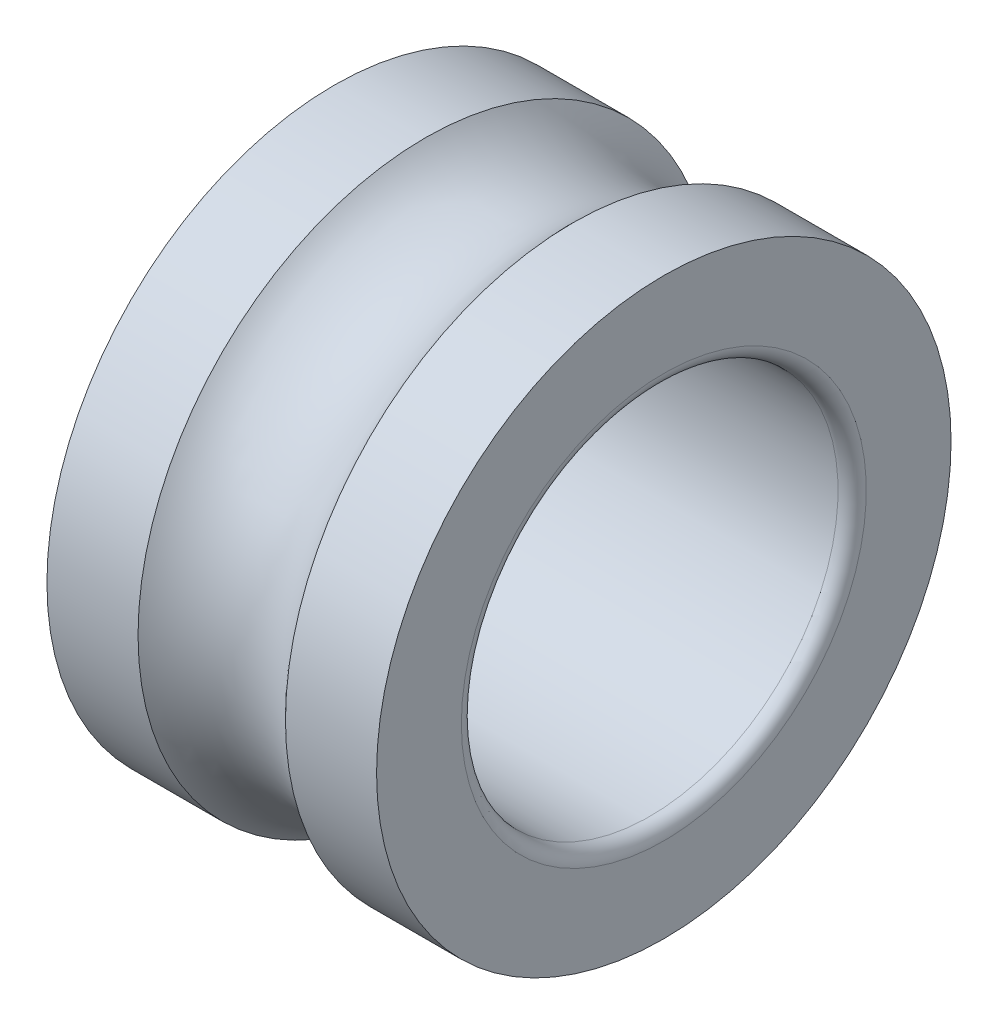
ISO-10303-21;
HEADER;
FILE_DESCRIPTION(('STEP AP214'),'2;1');
FILE_NAME('part.step','',(''),(''),'','','');
FILE_SCHEMA(('AUTOMOTIVE_DESIGN { 1 0 10303 214 1 1 1 1 }'));
ENDSEC;
DATA;
#1=APPLICATION_CONTEXT('core data for automotive mechanical design processes');
#2=APPLICATION_PROTOCOL_DEFINITION('international standard','automotive_design',2000,#1);
#3=PRODUCT_CONTEXT('',#1,'mechanical');
#4=PRODUCT('Part','Part','',(#3));
#5=PRODUCT_RELATED_PRODUCT_CATEGORY('part','',(#4));
#6=PRODUCT_DEFINITION_FORMATION('','',#4);
#7=PRODUCT_DEFINITION_CONTEXT('part definition',#1,'design');
#8=PRODUCT_DEFINITION('design','',#6,#7);
#9=PRODUCT_DEFINITION_SHAPE('','',#8);
#10=(LENGTH_UNIT() NAMED_UNIT(*) SI_UNIT(.MILLI.,.METRE.));
#11=(NAMED_UNIT(*) PLANE_ANGLE_UNIT() SI_UNIT($,.RADIAN.));
#12=(NAMED_UNIT(*) SI_UNIT($,.STERADIAN.) SOLID_ANGLE_UNIT());
#13=UNCERTAINTY_MEASURE_WITH_UNIT(LENGTH_MEASURE(1.E-05),#10,'distance_accuracy_value','');
#14=(GEOMETRIC_REPRESENTATION_CONTEXT(3) GLOBAL_UNCERTAINTY_ASSIGNED_CONTEXT((#13)) GLOBAL_UNIT_ASSIGNED_CONTEXT((#10,
#11,#12)) REPRESENTATION_CONTEXT('',''));
#15=CARTESIAN_POINT('',(0.,0.,0.));
#16=DIRECTION('',(0.,0.,1.));
#17=DIRECTION('',(1.,0.,0.));
#18=AXIS2_PLACEMENT_3D('',#15,#16,#17);
#19=CARTESIAN_POINT('',(0.300000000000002,0.,0.));
#20=DIRECTION('',(-1.,0.,0.));
#21=DIRECTION('',(0.,0.,1.));
#22=AXIS2_PLACEMENT_3D('',#19,#20,#21);
#23=TOROIDAL_SURFACE('',#22,4.3,0.300000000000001);
#24=CARTESIAN_POINT('',(0.300000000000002,0.,0.));
#25=DIRECTION('',(-1.,0.,0.));
#26=DIRECTION('',(0.,0.,1.));
#27=AXIS2_PLACEMENT_3D('',#24,#25,#26);
#28=CIRCLE('',#27,4.);
#29=CARTESIAN_POINT('',(0.300000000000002,0.,4.));
#30=VERTEX_POINT('',#29);
#31=EDGE_CURVE('E10',#30,#30,#28,.T.);
#32=ORIENTED_EDGE('',*,*,#31,.F.);
#33=EDGE_LOOP('',(#32));
#34=FACE_BOUND('',#33,.T.);
#35=CARTESIAN_POINT('',(0.,0.,0.));
#36=DIRECTION('',(-1.,0.,0.));
#37=DIRECTION('',(0.,0.,1.));
#38=AXIS2_PLACEMENT_3D('',#35,#36,#37);
#39=CIRCLE('',#38,4.3);
#40=CARTESIAN_POINT('',(0.,0.,4.3));
#41=VERTEX_POINT('',#40);
#42=EDGE_CURVE('E60',#41,#41,#39,.T.);
#43=ORIENTED_EDGE('',*,*,#42,.T.);
#44=EDGE_LOOP('',(#43));
#45=FACE_BOUND('',#44,.T.);
#46=ADVANCED_FACE('F32',(#34,#45),#23,.T.);
#47=CARTESIAN_POINT('',(0.,0.,0.));
#48=DIRECTION('',(-1.,0.,0.));
#49=DIRECTION('',(0.,0.,1.));
#50=AXIS2_PLACEMENT_3D('',#47,#48,#49);
#51=CYLINDRICAL_SURFACE('',#50,4.);
#52=CARTESIAN_POINT('',(6.7,0.,0.));
#53=DIRECTION('',(-1.,0.,0.));
#54=DIRECTION('',(0.,0.,1.));
#55=AXIS2_PLACEMENT_3D('',#52,#53,#54);
#56=CIRCLE('',#55,4.);
#57=CARTESIAN_POINT('',(6.7,0.,4.));
#58=VERTEX_POINT('',#57);
#59=EDGE_CURVE('E38',#58,#58,#56,.T.);
#60=ORIENTED_EDGE('',*,*,#59,.F.);
#61=EDGE_LOOP('',(#60));
#62=FACE_BOUND('',#61,.T.);
#63=ORIENTED_EDGE('',*,*,#31,.T.);
#64=EDGE_LOOP('',(#63));
#65=FACE_BOUND('',#64,.T.);
#66=ADVANCED_FACE('F97',(#62,#65),#51,.F.);
#67=CARTESIAN_POINT('',(6.7,0.,0.));
#68=DIRECTION('',(-1.,0.,0.));
#69=DIRECTION('',(0.,0.,1.));
#70=AXIS2_PLACEMENT_3D('',#67,#68,#69);
#71=TOROIDAL_SURFACE('',#70,4.3,0.300000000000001);
#72=CARTESIAN_POINT('',(7.,0.,0.));
#73=DIRECTION('',(-1.,0.,0.));
#74=DIRECTION('',(0.,0.,1.));
#75=AXIS2_PLACEMENT_3D('',#72,#73,#74);
#76=CIRCLE('',#75,4.3);
#77=CARTESIAN_POINT('',(7.,0.,4.3));
#78=VERTEX_POINT('',#77);
#79=EDGE_CURVE('E42',#78,#78,#76,.T.);
#80=ORIENTED_EDGE('',*,*,#79,.F.);
#81=EDGE_LOOP('',(#80));
#82=FACE_BOUND('',#81,.T.);
#83=ORIENTED_EDGE('',*,*,#59,.T.);
#84=EDGE_LOOP('',(#83));
#85=FACE_BOUND('',#84,.T.);
#86=ADVANCED_FACE('F92',(#82,#85),#71,.T.);
#87=CARTESIAN_POINT('',(7.,0.,-6.1));
#88=DIRECTION('',(-1.,0.,0.));
#89=DIRECTION('',(0.,0.,1.));
#90=AXIS2_PLACEMENT_3D('',#87,#88,#89);
#91=PLANE('',#90);
#92=CARTESIAN_POINT('',(7.,0.,0.));
#93=DIRECTION('',(-1.,0.,0.));
#94=DIRECTION('',(0.,0.,1.));
#95=AXIS2_PLACEMENT_3D('',#92,#93,#94);
#96=CIRCLE('',#95,6.1);
#97=CARTESIAN_POINT('',(7.,0.,6.1));
#98=VERTEX_POINT('',#97);
#99=EDGE_CURVE('E46',#98,#98,#96,.T.);
#100=ORIENTED_EDGE('',*,*,#99,.F.);
#101=EDGE_LOOP('',(#100));
#102=FACE_BOUND('',#101,.T.);
#103=ORIENTED_EDGE('',*,*,#79,.T.);
#104=EDGE_LOOP('',(#103));
#105=FACE_BOUND('',#104,.T.);
#106=ADVANCED_FACE('F86',(#102,#105),#91,.F.);
#107=CARTESIAN_POINT('',(0.,0.,0.));
#108=DIRECTION('',(-1.,0.,0.));
#109=DIRECTION('',(0.,0.,1.));
#110=AXIS2_PLACEMENT_3D('',#107,#108,#109);
#111=CYLINDRICAL_SURFACE('',#110,6.1);
#112=CARTESIAN_POINT('',(5.06524758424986,0.,0.));
#113=DIRECTION('',(-1.,0.,0.));
#114=DIRECTION('',(0.,0.,1.));
#115=AXIS2_PLACEMENT_3D('',#112,#113,#114);
#116=CIRCLE('',#115,6.1);
#117=CARTESIAN_POINT('',(5.06524758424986,0.,6.1));
#118=VERTEX_POINT('',#117);
#119=EDGE_CURVE('E51',#118,#118,#116,.T.);
#120=ORIENTED_EDGE('',*,*,#119,.F.);
#121=EDGE_LOOP('',(#120));
#122=FACE_BOUND('',#121,.T.);
#123=ORIENTED_EDGE('',*,*,#99,.T.);
#124=EDGE_LOOP('',(#123));
#125=FACE_BOUND('',#124,.T.);
#126=ADVANCED_FACE('F80',(#122,#125),#111,.T.);
#127=CARTESIAN_POINT('',(3.5,0.,0.));
#128=DIRECTION('',(-1.,0.,0.));
#129=DIRECTION('',(0.,0.,1.));
#130=AXIS2_PLACEMENT_3D('',#127,#128,#129);
#131=TOROIDAL_SURFACE('',#130,7.5,2.1);
#132=CARTESIAN_POINT('',(1.93475241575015,0.,0.));
#133=DIRECTION('',(-1.,0.,0.));
#134=DIRECTION('',(0.,0.,1.));
#135=AXIS2_PLACEMENT_3D('',#132,#133,#134);
#136=CIRCLE('',#135,6.1);
#137=CARTESIAN_POINT('',(1.93475241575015,0.,6.1));
#138=VERTEX_POINT('',#137);
#139=EDGE_CURVE('E54',#138,#138,#136,.T.);
#140=ORIENTED_EDGE('',*,*,#139,.F.);
#141=EDGE_LOOP('',(#140));
#142=FACE_BOUND('',#141,.T.);
#143=ORIENTED_EDGE('',*,*,#119,.T.);
#144=EDGE_LOOP('',(#143));
#145=FACE_BOUND('',#144,.T.);
#146=ADVANCED_FACE('F74',(#142,#145),#131,.F.);
#147=CARTESIAN_POINT('',(0.,0.,0.));
#148=DIRECTION('',(-1.,0.,0.));
#149=DIRECTION('',(0.,0.,1.));
#150=AXIS2_PLACEMENT_3D('',#147,#148,#149);
#151=CYLINDRICAL_SURFACE('',#150,6.1);
#152=CARTESIAN_POINT('',(0.,0.,0.));
#153=DIRECTION('',(-1.,0.,0.));
#154=DIRECTION('',(0.,0.,1.));
#155=AXIS2_PLACEMENT_3D('',#152,#153,#154);
#156=CIRCLE('',#155,6.1);
#157=CARTESIAN_POINT('',(0.,0.,6.1));
#158=VERTEX_POINT('',#157);
#159=EDGE_CURVE('E57',#158,#158,#156,.T.);
#160=ORIENTED_EDGE('',*,*,#159,.F.);
#161=EDGE_LOOP('',(#160));
#162=FACE_BOUND('',#161,.T.);
#163=ORIENTED_EDGE('',*,*,#139,.T.);
#164=EDGE_LOOP('',(#163));
#165=FACE_BOUND('',#164,.T.);
#166=ADVANCED_FACE('F68',(#162,#165),#151,.T.);
#167=CARTESIAN_POINT('',(0.,0.,-6.1));
#168=DIRECTION('',(1.,0.,0.));
#169=DIRECTION('',(0.,0.,-1.));
#170=AXIS2_PLACEMENT_3D('',#167,#168,#169);
#171=PLANE('',#170);
#172=ORIENTED_EDGE('',*,*,#42,.F.);
#173=EDGE_LOOP('',(#172));
#174=FACE_BOUND('',#173,.T.);
#175=ORIENTED_EDGE('',*,*,#159,.T.);
#176=EDGE_LOOP('',(#175));
#177=FACE_BOUND('',#176,.T.);
#178=ADVANCED_FACE('F65',(#174,#177),#171,.F.);
#179=CLOSED_SHELL('',(#46,#66,#86,#106,#126,#146,#166,#178));
#180=MANIFOLD_SOLID_BREP('B2',#179);
#181=ADVANCED_BREP_SHAPE_REPRESENTATION('',(#18,#180),#14);
#182=SHAPE_DEFINITION_REPRESENTATION(#9,#181);
ENDSEC;
END-ISO-10303-21;
